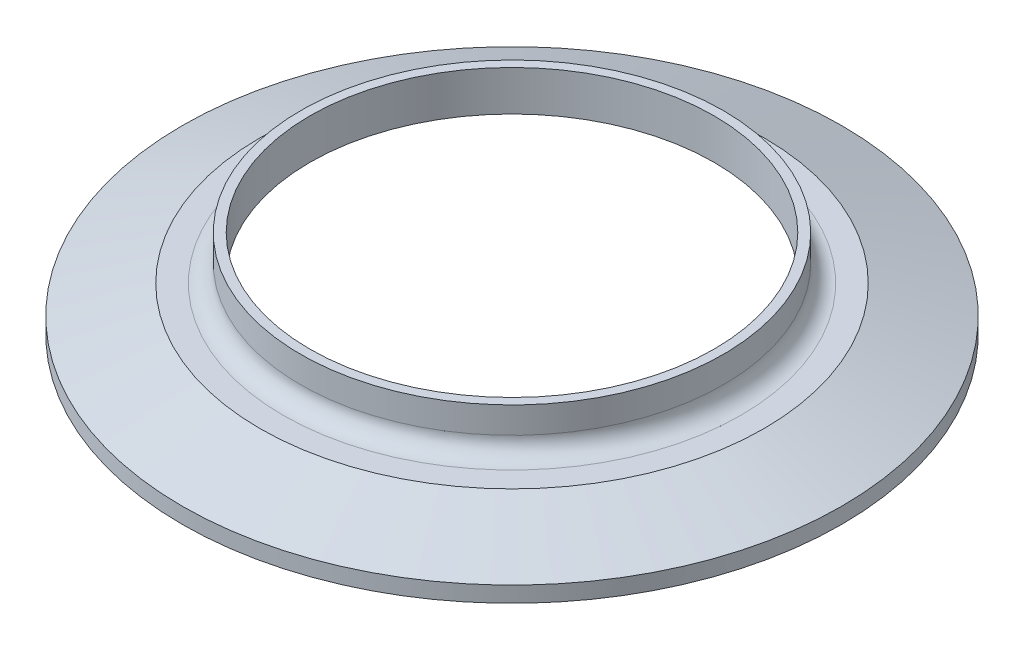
ISO-10303-21;
HEADER;
FILE_DESCRIPTION(('STEP AP214'),'2;1');
FILE_NAME('part.step','',(''),(''),'','','');
FILE_SCHEMA(('AUTOMOTIVE_DESIGN { 1 0 10303 214 1 1 1 1 }'));
ENDSEC;
DATA;
#1=APPLICATION_CONTEXT('core data for automotive mechanical design processes');
#2=APPLICATION_PROTOCOL_DEFINITION('international standard','automotive_design',2000,#1);
#3=PRODUCT_CONTEXT('',#1,'mechanical');
#4=PRODUCT('Part','Part','',(#3));
#5=PRODUCT_RELATED_PRODUCT_CATEGORY('part','',(#4));
#6=PRODUCT_DEFINITION_FORMATION('','',#4);
#7=PRODUCT_DEFINITION_CONTEXT('part definition',#1,'design');
#8=PRODUCT_DEFINITION('design','',#6,#7);
#9=PRODUCT_DEFINITION_SHAPE('','',#8);
#10=(LENGTH_UNIT() NAMED_UNIT(*) SI_UNIT(.MILLI.,.METRE.));
#11=(NAMED_UNIT(*) PLANE_ANGLE_UNIT() SI_UNIT($,.RADIAN.));
#12=(NAMED_UNIT(*) SI_UNIT($,.STERADIAN.) SOLID_ANGLE_UNIT());
#13=UNCERTAINTY_MEASURE_WITH_UNIT(LENGTH_MEASURE(1.E-05),#10,'distance_accuracy_value','');
#14=(GEOMETRIC_REPRESENTATION_CONTEXT(3) GLOBAL_UNCERTAINTY_ASSIGNED_CONTEXT((#13)) GLOBAL_UNIT_ASSIGNED_CONTEXT((#10,
#11,#12)) REPRESENTATION_CONTEXT('',''));
#15=CARTESIAN_POINT('',(0.,0.,0.));
#16=DIRECTION('',(0.,0.,1.));
#17=DIRECTION('',(1.,0.,0.));
#18=AXIS2_PLACEMENT_3D('',#15,#16,#17);
#19=CARTESIAN_POINT('',(-36.449,15.875,0.));
#20=DIRECTION('',(0.,-1.,0.));
#21=DIRECTION('',(0.,0.,-1.));
#22=AXIS2_PLACEMENT_3D('',#19,#20,#21);
#23=PLANE('',#22);
#24=CARTESIAN_POINT('',(0.,15.875,0.));
#25=DIRECTION('',(0.,-1.,0.));
#26=DIRECTION('',(0.,0.,-1.));
#27=AXIS2_PLACEMENT_3D('',#24,#25,#26);
#28=CIRCLE('',#27,38.1);
#29=CARTESIAN_POINT('',(0.,15.875,-38.1));
#30=VERTEX_POINT('',#29);
#31=EDGE_CURVE('E12',#30,#30,#28,.T.);
#32=ORIENTED_EDGE('',*,*,#31,.F.);
#33=EDGE_LOOP('',(#32));
#34=FACE_BOUND('',#33,.T.);
#35=CARTESIAN_POINT('',(0.,15.875,0.));
#36=DIRECTION('',(0.,-1.,0.));
#37=DIRECTION('',(0.,0.,-1.));
#38=AXIS2_PLACEMENT_3D('',#35,#36,#37);
#39=CIRCLE('',#38,36.449);
#40=CARTESIAN_POINT('',(0.,15.875,-36.449));
#41=VERTEX_POINT('',#40);
#42=EDGE_CURVE('E87',#41,#41,#39,.T.);
#43=ORIENTED_EDGE('',*,*,#42,.T.);
#44=EDGE_LOOP('',(#43));
#45=FACE_BOUND('',#44,.T.);
#46=ADVANCED_FACE('F38',(#34,#45),#23,.F.);
#47=CARTESIAN_POINT('',(0.,0.,0.));
#48=DIRECTION('',(0.,-1.,0.));
#49=DIRECTION('',(0.,0.,-1.));
#50=AXIS2_PLACEMENT_3D('',#47,#48,#49);
#51=CYLINDRICAL_SURFACE('',#50,38.1);
#52=CARTESIAN_POINT('',(0.,11.1252,0.));
#53=DIRECTION('',(0.,-1.,0.));
#54=DIRECTION('',(0.,0.,-1.));
#55=AXIS2_PLACEMENT_3D('',#52,#53,#54);
#56=CIRCLE('',#55,38.1);
#57=CARTESIAN_POINT('',(0.,11.1252,-38.1));
#58=VERTEX_POINT('',#57);
#59=EDGE_CURVE('E44',#58,#58,#56,.T.);
#60=ORIENTED_EDGE('',*,*,#59,.F.);
#61=EDGE_LOOP('',(#60));
#62=FACE_BOUND('',#61,.T.);
#63=ORIENTED_EDGE('',*,*,#31,.T.);
#64=EDGE_LOOP('',(#63));
#65=FACE_BOUND('',#64,.T.);
#66=ADVANCED_FACE('F166',(#62,#65),#51,.T.);
#67=CARTESIAN_POINT('',(0.,11.1252,0.));
#68=DIRECTION('',(0.,-1.,0.));
#69=DIRECTION('',(0.,0.,-1.));
#70=AXIS2_PLACEMENT_3D('',#67,#68,#69);
#71=TOROIDAL_SURFACE('',#70,41.275,3.175);
#72=CARTESIAN_POINT('',(0.,7.9502,0.));
#73=DIRECTION('',(0.,-1.,0.));
#74=DIRECTION('',(0.,0.,-1.));
#75=AXIS2_PLACEMENT_3D('',#72,#73,#74);
#76=CIRCLE('',#75,41.275);
#77=CARTESIAN_POINT('',(0.,7.9502,-41.275));
#78=VERTEX_POINT('',#77);
#79=EDGE_CURVE('E48',#78,#78,#76,.T.);
#80=ORIENTED_EDGE('',*,*,#79,.F.);
#81=EDGE_LOOP('',(#80));
#82=FACE_BOUND('',#81,.T.);
#83=ORIENTED_EDGE('',*,*,#59,.T.);
#84=EDGE_LOOP('',(#83));
#85=FACE_BOUND('',#84,.T.);
#86=ADVANCED_FACE('F161',(#82,#85),#71,.F.);
#87=CARTESIAN_POINT('',(-41.275,7.9502,0.));
#88=DIRECTION('',(0.,-1.,0.));
#89=DIRECTION('',(0.,0.,-1.));
#90=AXIS2_PLACEMENT_3D('',#87,#88,#89);
#91=PLANE('',#90);
#92=CARTESIAN_POINT('',(0.,7.9502,0.));
#93=DIRECTION('',(0.,-1.,0.));
#94=DIRECTION('',(0.,0.,-1.));
#95=AXIS2_PLACEMENT_3D('',#92,#93,#94);
#96=CIRCLE('',#95,45.4344287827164);
#97=CARTESIAN_POINT('',(0.,7.9502,-45.4344287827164));
#98=VERTEX_POINT('',#97);
#99=EDGE_CURVE('E52',#98,#98,#96,.T.);
#100=ORIENTED_EDGE('',*,*,#99,.F.);
#101=EDGE_LOOP('',(#100));
#102=FACE_BOUND('',#101,.T.);
#103=ORIENTED_EDGE('',*,*,#79,.T.);
#104=EDGE_LOOP('',(#103));
#105=FACE_BOUND('',#104,.T.);
#106=ADVANCED_FACE('F155',(#102,#105),#91,.F.);
#107=CARTESIAN_POINT('',(0.,7.9502,0.));
#108=DIRECTION('',(0.,-1.,0.));
#109=DIRECTION('',(0.,0.,-1.));
#110=AXIS2_PLACEMENT_3D('',#107,#108,#109);
#111=CONICAL_SURFACE('',#110,45.4344287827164,1.22173047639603);
#112=CARTESIAN_POINT('',(0.,2.8448,0.));
#113=DIRECTION('',(0.,-1.,0.));
#114=DIRECTION('',(0.,0.,-1.));
#115=AXIS2_PLACEMENT_3D('',#112,#113,#114);
#116=CIRCLE('',#115,59.4614);
#117=CARTESIAN_POINT('',(0.,2.8448,-59.4614));
#118=VERTEX_POINT('',#117);
#119=EDGE_CURVE('E57',#118,#118,#116,.T.);
#120=ORIENTED_EDGE('',*,*,#119,.F.);
#121=EDGE_LOOP('',(#120));
#122=FACE_BOUND('',#121,.T.);
#123=ORIENTED_EDGE('',*,*,#99,.T.);
#124=EDGE_LOOP('',(#123));
#125=FACE_BOUND('',#124,.T.);
#126=ADVANCED_FACE('F149',(#122,#125),#111,.T.);
#127=CARTESIAN_POINT('',(0.,0.,0.));
#128=DIRECTION('',(0.,-1.,0.));
#129=DIRECTION('',(0.,0.,-1.));
#130=AXIS2_PLACEMENT_3D('',#127,#128,#129);
#131=CYLINDRICAL_SURFACE('',#130,59.4614);
#132=CARTESIAN_POINT('',(0.,0.,0.));
#133=DIRECTION('',(0.,-1.,0.));
#134=DIRECTION('',(0.,0.,-1.));
#135=AXIS2_PLACEMENT_3D('',#132,#133,#134);
#136=CIRCLE('',#135,59.4614);
#137=CARTESIAN_POINT('',(0.,0.,-59.4614));
#138=VERTEX_POINT('',#137);
#139=EDGE_CURVE('E60',#138,#138,#136,.T.);
#140=ORIENTED_EDGE('',*,*,#139,.F.);
#141=EDGE_LOOP('',(#140));
#142=FACE_BOUND('',#141,.T.);
#143=ORIENTED_EDGE('',*,*,#119,.T.);
#144=EDGE_LOOP('',(#143));
#145=FACE_BOUND('',#144,.T.);
#146=ADVANCED_FACE('F143',(#142,#145),#131,.T.);
#147=CARTESIAN_POINT('',(-59.4614,0.,0.));
#148=DIRECTION('',(0.,1.,0.));
#149=DIRECTION('',(0.,0.,1.));
#150=AXIS2_PLACEMENT_3D('',#147,#148,#149);
#151=PLANE('',#150);
#152=CARTESIAN_POINT('',(0.,0.,0.));
#153=DIRECTION('',(0.,-1.,0.));
#154=DIRECTION('',(0.,0.,-1.));
#155=AXIS2_PLACEMENT_3D('',#152,#153,#154);
#156=CIRCLE('',#155,56.924857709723);
#157=CARTESIAN_POINT('',(0.,0.,-56.924857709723));
#158=VERTEX_POINT('',#157);
#159=EDGE_CURVE('E63',#158,#158,#156,.T.);
#160=ORIENTED_EDGE('',*,*,#159,.F.);
#161=EDGE_LOOP('',(#160));
#162=FACE_BOUND('',#161,.T.);
#163=ORIENTED_EDGE('',*,*,#139,.T.);
#164=EDGE_LOOP('',(#163));
#165=FACE_BOUND('',#164,.T.);
#166=ADVANCED_FACE('F137',(#162,#165),#151,.F.);
#167=CARTESIAN_POINT('',(0.,0.776719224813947,0.));
#168=DIRECTION('',(0.,-1.,0.));
#169=DIRECTION('',(0.,0.,-1.));
#170=AXIS2_PLACEMENT_3D('',#167,#168,#169);
#171=TOROIDAL_SURFACE('',#170,56.7956059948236,0.787400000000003);
#172=CARTESIAN_POINT('',(0.,0.469057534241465,0.));
#173=DIRECTION('',(0.,-1.,0.));
#174=DIRECTION('',(0.,0.,-1.));
#175=AXIS2_PLACEMENT_3D('',#172,#173,#174);
#176=CIRCLE('',#175,56.0708004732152);
#177=CARTESIAN_POINT('',(0.,0.469057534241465,-56.0708004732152));
#178=VERTEX_POINT('',#177);
#179=EDGE_CURVE('E66',#178,#178,#176,.T.);
#180=ORIENTED_EDGE('',*,*,#179,.F.);
#181=EDGE_LOOP('',(#180));
#182=FACE_BOUND('',#181,.T.);
#183=ORIENTED_EDGE('',*,*,#159,.T.);
#184=EDGE_LOOP('',(#183));
#185=FACE_BOUND('',#184,.T.);
#186=ADVANCED_FACE('F131',(#182,#185),#171,.T.);
#187=CARTESIAN_POINT('',(0.,0.469057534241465,0.));
#188=DIRECTION('',(0.,-1.,0.));
#189=DIRECTION('',(0.,0.,-1.));
#190=AXIS2_PLACEMENT_3D('',#187,#188,#189);
#191=CONICAL_SURFACE('',#190,56.0708004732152,0.401425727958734);
#192=CARTESIAN_POINT('',(0.,0.872854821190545,0.));
#193=DIRECTION('',(0.,-1.,0.));
#194=DIRECTION('',(0.,0.,-1.));
#195=AXIS2_PLACEMENT_3D('',#192,#193,#194);
#196=CIRCLE('',#195,55.8993986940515);
#197=CARTESIAN_POINT('',(0.,0.872854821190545,-55.8993986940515));
#198=VERTEX_POINT('',#197);
#199=EDGE_CURVE('E69',#198,#198,#196,.T.);
#200=ORIENTED_EDGE('',*,*,#199,.F.);
#201=EDGE_LOOP('',(#200));
#202=FACE_BOUND('',#201,.T.);
#203=ORIENTED_EDGE('',*,*,#179,.T.);
#204=EDGE_LOOP('',(#203));
#205=FACE_BOUND('',#204,.T.);
#206=ADVANCED_FACE('F125',(#202,#205),#191,.F.);
#207=CARTESIAN_POINT('',(0.,0.406400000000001,0.));
#208=DIRECTION('',(0.,-1.,0.));
#209=DIRECTION('',(0.,0.,-1.));
#210=AXIS2_PLACEMENT_3D('',#207,#208,#209);
#211=TOROIDAL_SURFACE('',#210,54.8005,1.1938);
#212=CARTESIAN_POINT('',(0.,0.872854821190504,0.));
#213=DIRECTION('',(0.,-1.,0.));
#214=DIRECTION('',(0.,0.,-1.));
#215=AXIS2_PLACEMENT_3D('',#212,#213,#214);
#216=CIRCLE('',#215,53.7016013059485);
#217=CARTESIAN_POINT('',(0.,0.872854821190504,-53.7016013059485));
#218=VERTEX_POINT('',#217);
#219=EDGE_CURVE('E72',#218,#218,#216,.T.);
#220=ORIENTED_EDGE('',*,*,#219,.F.);
#221=EDGE_LOOP('',(#220));
#222=FACE_BOUND('',#221,.T.);
#223=ORIENTED_EDGE('',*,*,#199,.T.);
#224=EDGE_LOOP('',(#223));
#225=FACE_BOUND('',#224,.T.);
#226=ADVANCED_FACE('F119',(#222,#225),#211,.F.);
#227=CARTESIAN_POINT('',(0.,0.872854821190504,0.));
#228=DIRECTION('',(0.,1.,0.));
#229=DIRECTION('',(0.,0.,1.));
#230=AXIS2_PLACEMENT_3D('',#227,#228,#229);
#231=CONICAL_SURFACE('',#230,53.7016013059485,0.401425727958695);
#232=CARTESIAN_POINT('',(0.,0.479738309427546,0.));
#233=DIRECTION('',(0.,-1.,0.));
#234=DIRECTION('',(0.,0.,-1.));
#235=AXIS2_PLACEMENT_3D('',#232,#233,#234);
#236=CIRCLE('',#235,53.5347332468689);
#237=CARTESIAN_POINT('',(0.,0.479738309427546,-53.5347332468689));
#238=VERTEX_POINT('',#237);
#239=EDGE_CURVE('E75',#238,#238,#236,.T.);
#240=ORIENTED_EDGE('',*,*,#239,.F.);
#241=EDGE_LOOP('',(#240));
#242=FACE_BOUND('',#241,.T.);
#243=ORIENTED_EDGE('',*,*,#219,.T.);
#244=EDGE_LOOP('',(#243));
#245=FACE_BOUND('',#244,.T.);
#246=ADVANCED_FACE('F113',(#242,#245),#231,.T.);
#247=CARTESIAN_POINT('',(0.,0.787400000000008,0.));
#248=DIRECTION('',(0.,-1.,0.));
#249=DIRECTION('',(0.,0.,-1.));
#250=AXIS2_PLACEMENT_3D('',#247,#248,#249);
#251=TOROIDAL_SURFACE('',#250,52.8099277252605,0.787399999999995);
#252=CARTESIAN_POINT('',(0.,0.,0.));
#253=DIRECTION('',(0.,-1.,0.));
#254=DIRECTION('',(0.,0.,-1.));
#255=AXIS2_PLACEMENT_3D('',#252,#253,#254);
#256=CIRCLE('',#255,52.8099277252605);
#257=CARTESIAN_POINT('',(0.,0.,-52.8099277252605));
#258=VERTEX_POINT('',#257);
#259=EDGE_CURVE('E78',#258,#258,#256,.T.);
#260=ORIENTED_EDGE('',*,*,#259,.F.);
#261=EDGE_LOOP('',(#260));
#262=FACE_BOUND('',#261,.T.);
#263=ORIENTED_EDGE('',*,*,#239,.T.);
#264=EDGE_LOOP('',(#263));
#265=FACE_BOUND('',#264,.T.);
#266=ADVANCED_FACE('F107',(#262,#265),#251,.T.);
#267=CARTESIAN_POINT('',(-48.6918,0.,0.));
#268=DIRECTION('',(0.,1.,0.));
#269=DIRECTION('',(0.,0.,1.));
#270=AXIS2_PLACEMENT_3D('',#267,#268,#269);
#271=PLANE('',#270);
#272=CARTESIAN_POINT('',(0.,0.,0.));
#273=DIRECTION('',(0.,-1.,0.));
#274=DIRECTION('',(0.,0.,-1.));
#275=AXIS2_PLACEMENT_3D('',#272,#273,#274);
#276=CIRCLE('',#275,48.6918);
#277=CARTESIAN_POINT('',(0.,0.,-48.6918));
#278=VERTEX_POINT('',#277);
#279=EDGE_CURVE('E81',#278,#278,#276,.T.);
#280=ORIENTED_EDGE('',*,*,#279,.F.);
#281=EDGE_LOOP('',(#280));
#282=FACE_BOUND('',#281,.T.);
#283=ORIENTED_EDGE('',*,*,#259,.T.);
#284=EDGE_LOOP('',(#283));
#285=FACE_BOUND('',#284,.T.);
#286=ADVANCED_FACE('F101',(#282,#285),#271,.F.);
#287=CARTESIAN_POINT('',(0.,0.,0.));
#288=DIRECTION('',(0.,-1.,0.));
#289=DIRECTION('',(0.,0.,-1.));
#290=AXIS2_PLACEMENT_3D('',#287,#288,#289);
#291=CONICAL_SURFACE('',#290,48.6918,0.958185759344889);
#292=CARTESIAN_POINT('',(0.,8.60438395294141,0.));
#293=DIRECTION('',(0.,-1.,0.));
#294=DIRECTION('',(0.,0.,-1.));
#295=AXIS2_PLACEMENT_3D('',#292,#293,#294);
#296=CIRCLE('',#295,36.449);
#297=CARTESIAN_POINT('',(0.,8.60438395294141,-36.449));
#298=VERTEX_POINT('',#297);
#299=EDGE_CURVE('E84',#298,#298,#296,.T.);
#300=ORIENTED_EDGE('',*,*,#299,.F.);
#301=EDGE_LOOP('',(#300));
#302=FACE_BOUND('',#301,.T.);
#303=ORIENTED_EDGE('',*,*,#279,.T.);
#304=EDGE_LOOP('',(#303));
#305=FACE_BOUND('',#304,.T.);
#306=ADVANCED_FACE('F95',(#302,#305),#291,.F.);
#307=CARTESIAN_POINT('',(0.,0.,0.));
#308=DIRECTION('',(0.,-1.,0.));
#309=DIRECTION('',(0.,0.,-1.));
#310=AXIS2_PLACEMENT_3D('',#307,#308,#309);
#311=CYLINDRICAL_SURFACE('',#310,36.449);
#312=ORIENTED_EDGE('',*,*,#42,.F.);
#313=EDGE_LOOP('',(#312));
#314=FACE_BOUND('',#313,.T.);
#315=ORIENTED_EDGE('',*,*,#299,.T.);
#316=EDGE_LOOP('',(#315));
#317=FACE_BOUND('',#316,.T.);
#318=ADVANCED_FACE('F92',(#314,#317),#311,.F.);
#319=CLOSED_SHELL('',(#46,#66,#86,#106,#126,#146,#166,#186,#206,#226,#246,#266,#286,#306,#318));
#320=MANIFOLD_SOLID_BREP('B2',#319);
#321=ADVANCED_BREP_SHAPE_REPRESENTATION('',(#18,#320),#14);
#322=SHAPE_DEFINITION_REPRESENTATION(#9,#321);
ENDSEC;
END-ISO-10303-21;
